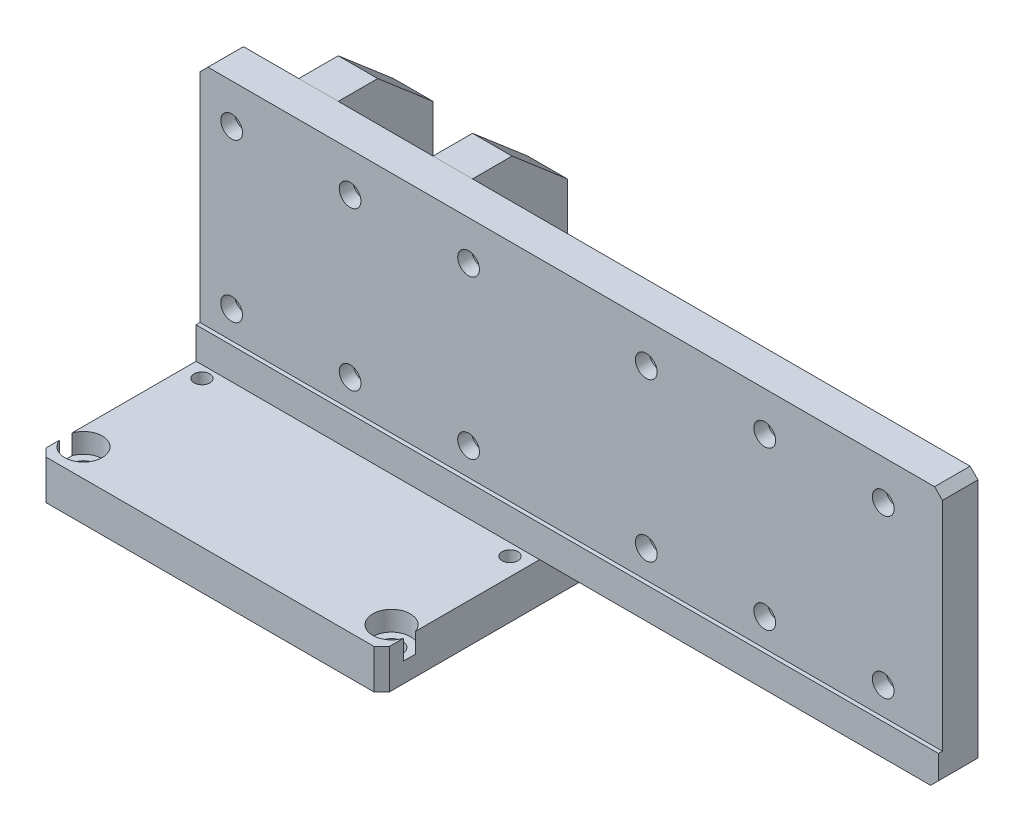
from build123d import *

# Parameters (mm, degrees)
SKETCH_1_W                  = 87
SKETCH_1_H                  = 74
EXTRUDE_1_DEPTH             = 10
SKETCH_2_W                  = 188
SKETCH_2_H                  = 10
EXTRUDE_2_DEPTH             = 65
SKETCH_3_W                  = 188
SKETCH_3_H                  = 57
CUT_EXTRUDE_1_DEPTH         = 1
SKETCH_4_W                  = 10
SKETCH_4_H                  = 24
EXTRUDE_3_DEPTH             = 65
EXTRUDE_3_2_DEPTH           = 65
CUT_EXTRUDE_2_DEPTH         = 153.898659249
HOLE_WIZARD_M5_1_AT_2_COUNT = 2
HOLE_WIZARD_M5_1_AT_2_PITCH = 78
HOLE_WIZARD_M5_1_AT_3_COUNT = 2
HOLE_WIZARD_M5_1_AT_3_PITCH = 60
HOLE_WIZARD_M5_1_AT_4_COUNT = 2
HOLE_WIZARD_M5_1_AT_4_PITCH = 98.407316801
SKETCH_9_W                  = 2
SKETCH_9_H                  = 10
F_4_0MM_1_AT_2_COUNT        = 2
F_4_0MM_1_AT_2_PITCH        = 78
HOLE_WIZARD_M5_2_AT_2_COUNT = 2
HOLE_WIZARD_M5_2_AT_2_PITCH = 30
HOLE_WIZARD_M5_2_AT_3_COUNT = 2
HOLE_WIZARD_M5_2_AT_3_PITCH = 60
HOLE_WIZARD_M5_2_AT_4_COUNT = 2
HOLE_WIZARD_M5_2_AT_4_PITCH = 72.111025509
HOLE_WIZARD_M5_2_AT_5_COUNT = 2
HOLE_WIZARD_M5_2_AT_5_PITCH = 50
HOLE_WIZARD_M5_2_AT_6_COUNT = 2
HOLE_WIZARD_M5_2_AT_6_PITCH = 40
CHAMFER_1_SIZE              = 2
CHAMFER_2_SIZE              = 2
PATTERN_LINEAR_1_COUNT      = 2
PATTERN_LINEAR_1_PITCH      = 105


with BuildPart() as part:
    # Sketch 1 → Extrude 1 (new body)
    with BuildSketch(Plane(origin=(0, 0, 0), x_dir=(1, 0, 0), z_dir=(0, 1, 0))):
        Rectangle(SKETCH_1_W, SKETCH_1_H)
    extrude(amount=EXTRUDE_1_DEPTH)

    # Sketch 7 → Hole Wizard M5 _ _ _ _ _1 (revolve, cut)
    with BuildSketch(Plane(origin=(-39, 10, -30), x_dir=(0, 0, 1), z_dir=(1, 0, 0))):
        Polygon((0, 0), (0, 10), (2.75, 10), (2.75, 5), (4.75, 5), (4.75, 0), align=None)
    hole_wizard_m5_1 = revolve(axis=Axis((-39, 16.35, -30), (0, -1, 0)), mode=Mode.SUBTRACT)

    # Hole Wizard M5 _ _ _ _ _1 at 2: Hole Wizard M5 _ _ _ _ _1 ×2
    with Locations(*[(i * HOLE_WIZARD_M5_1_AT_2_PITCH, 0, 0) for i in range(1, HOLE_WIZARD_M5_1_AT_2_COUNT)]):
        add(hole_wizard_m5_1, mode=Mode.SUBTRACT)

    # Hole Wizard M5 _ _ _ _ _1 at 3: Hole Wizard M5 _ _ _ _ _1 ×2
    with Locations(*[(0, 0, i * HOLE_WIZARD_M5_1_AT_3_PITCH) for i in range(1, HOLE_WIZARD_M5_1_AT_3_COUNT)]):
        add(hole_wizard_m5_1, mode=Mode.SUBTRACT)

    # Hole Wizard M5 _ _ _ _ _1 at 4: Hole Wizard M5 _ _ _ _ _1 ×2
    with Locations(*[Vector(0.7926239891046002, 0, 0.6097107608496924) * (i * HOLE_WIZARD_M5_1_AT_4_PITCH) for i in range(1, HOLE_WIZARD_M5_1_AT_4_COUNT)]):
        add(hole_wizard_m5_1, mode=Mode.SUBTRACT)

    # Sketch 9 → 4.0mm _ _1 (revolve, cut)
    with BuildSketch(Plane(origin=(-39, 10, 0), x_dir=(0, 0, 1), z_dir=(1, 0, 0))):
        with Locations((1, 5)):
            Rectangle(SKETCH_9_W, SKETCH_9_H)
    f_4_0mm_1 = revolve(axis=Axis((-39, 16.35, 0), (0, -1, 0)), mode=Mode.SUBTRACT)

    # 4.0mm _ _1 at 2: 4.0mm _ _1 ×2
    with Locations(*[(i * F_4_0MM_1_AT_2_PITCH, 0, 0) for i in range(1, F_4_0MM_1_AT_2_COUNT)]):
        add(f_4_0mm_1, mode=Mode.SUBTRACT)

    # Chamfer 2
    chamfer_2_edges = [part.edges().sort_by_distance(p)[0] for p in [
        (43.5, 5, 37),
        (-43.5, 5, 37),
        (-43.5, 5, -37),
        (43.5, 5, -37),
    ]]
    chamfer(chamfer_2_edges, length=CHAMFER_2_SIZE)


with BuildPart() as body_2:
    # Sketch 2 → Extrude 2 (new body)
    with BuildSketch(Plane(origin=(0, 10, 0), x_dir=(1, 0, 0), z_dir=(0, 1, 0))):
        with Locations((50.5, 8)):
            Rectangle(SKETCH_2_W, SKETCH_2_H)
    extrude(amount=EXTRUDE_2_DEPTH)

    # Sketch 3 → Cut-Extrude 1 (cut)
    with BuildSketch(Plane.XY.offset(-3)):
        with Locations((50.5, 46.5)):
            Rectangle(SKETCH_3_W, SKETCH_3_H)
    extrude(amount=-CUT_EXTRUDE_1_DEPTH, mode=Mode.SUBTRACT)

    # Sketch 11 → Hole Wizard M5 _ _ _ _ _2 (revolve, cut)
    with BuildSketch(Plane(origin=(-35.5, 65, -13), x_dir=(0, 1, 0), z_dir=(1, 0, 0))):
        Polygon((0, 0), (0, 50), (2.75, 50), (2.75, 5.5), (4.75, 5.5), (4.75, 0), align=None)
    hole_wizard_m5_2 = revolve(axis=Axis((-35.5, 65, -19.35), (0, 0, 1)), mode=Mode.SUBTRACT)

    # Hole Wizard M5 _ _ _ _ _2 at 2: Hole Wizard M5 _ _ _ _ _2 ×2
    with Locations(*[(i * HOLE_WIZARD_M5_2_AT_2_PITCH, 0, 0) for i in range(1, HOLE_WIZARD_M5_2_AT_2_COUNT)]):
        add(hole_wizard_m5_2, mode=Mode.SUBTRACT)

    # Hole Wizard M5 _ _ _ _ _2 at 3: Hole Wizard M5 _ _ _ _ _2 ×2
    with Locations(*[(i * HOLE_WIZARD_M5_2_AT_3_PITCH, 0, 0) for i in range(1, HOLE_WIZARD_M5_2_AT_3_COUNT)]):
        add(hole_wizard_m5_2, mode=Mode.SUBTRACT)

    # Hole Wizard M5 _ _ _ _ _2 at 4: Hole Wizard M5 _ _ _ _ _2 ×2
    with Locations(*[Vector(0.8320502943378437, -0.5547001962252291, 0) * (i * HOLE_WIZARD_M5_2_AT_4_PITCH) for i in range(1, HOLE_WIZARD_M5_2_AT_4_COUNT)]):
        add(hole_wizard_m5_2, mode=Mode.SUBTRACT)

    # Hole Wizard M5 _ _ _ _ _2 at 5: Hole Wizard M5 _ _ _ _ _2 ×2
    with Locations(*[Vector(0.6, -0.8, 0) * (i * HOLE_WIZARD_M5_2_AT_5_PITCH) for i in range(1, HOLE_WIZARD_M5_2_AT_5_COUNT)]):
        add(hole_wizard_m5_2, mode=Mode.SUBTRACT)

    # Hole Wizard M5 _ _ _ _ _2 at 6: Hole Wizard M5 _ _ _ _ _2 ×2
    with Locations(*[(0, -i * HOLE_WIZARD_M5_2_AT_6_PITCH, 0) for i in range(1, HOLE_WIZARD_M5_2_AT_6_COUNT)]):
        add(hole_wizard_m5_2, mode=Mode.SUBTRACT)

    # Chamfer 1
    chamfer_1_edges = [body_2.edges().sort_by_distance(p)[0] for p in [
        (144.5, 75, -8.5),
        (-43.5, 75, -8.5),
        (144.5, 10, -8),
    ]]
    chamfer(chamfer_1_edges, length=CHAMFER_1_SIZE)

    # Pattern Linear 1: Hole Wizard M5 _ _ _ _ _2 ×2
    with Locations(*[(i * PATTERN_LINEAR_1_PITCH, 0, 0) for i in range(1, PATTERN_LINEAR_1_COUNT)]):
        add(hole_wizard_m5_2, mode=Mode.SUBTRACT)

    # Pattern Linear 1 copy 1 sketch → Pattern Linear 1 copy 1 (revolve, cut)
    with BuildSketch(Plane(origin=(99.5, 65, -13), x_dir=(0, 1, 0), z_dir=(1, 0, 0))):
        Polygon((0, 0), (0, 50), (2.75, 50), (2.75, 5.5), (4.75, 5.5), (4.75, 0), align=None)
    revolve(axis=Axis((99.5, 65, -19.35), (0, 0, 1)), mode=Mode.SUBTRACT)

    # Pattern Linear 1 copy 2 sketch → Pattern Linear 1 copy 2 (revolve, cut)
    with BuildSketch(Plane(origin=(129.5, 65, -13), x_dir=(0, 1, 0), z_dir=(1, 0, 0))):
        Polygon((0, 0), (0, 50), (2.75, 50), (2.75, 5.5), (4.75, 5.5), (4.75, 0), align=None)
    revolve(axis=Axis((129.5, 65, -19.35), (0, 0, 1)), mode=Mode.SUBTRACT)

    # Pattern Linear 1 copy 3 sketch → Pattern Linear 1 copy 3 (revolve, cut)
    with BuildSketch(Plane(origin=(129.5, 25, -13), x_dir=(0, 1, 0), z_dir=(1, 0, 0))):
        Polygon((0, 0), (0, 50), (2.75, 50), (2.75, 5.5), (4.75, 5.5), (4.75, 0), align=None)
    revolve(axis=Axis((129.5, 25, -19.35), (0, 0, 1)), mode=Mode.SUBTRACT)

    # Pattern Linear 1 copy 4 sketch → Pattern Linear 1 copy 4 (revolve, cut)
    with BuildSketch(Plane(origin=(99.5, 25, -13), x_dir=(0, 1, 0), z_dir=(1, 0, 0))):
        Polygon((0, 0), (0, 50), (2.75, 50), (2.75, 5.5), (4.75, 5.5), (4.75, 0), align=None)
    revolve(axis=Axis((99.5, 25, -19.35), (0, 0, 1)), mode=Mode.SUBTRACT)

    # Pattern Linear 1 copy 5 sketch → Pattern Linear 1 copy 5 (revolve, cut)
    with BuildSketch(Plane(origin=(69.5, 25, -13), x_dir=(0, 1, 0), z_dir=(1, 0, 0))):
        Polygon((0, 0), (0, 50), (2.75, 50), (2.75, 5.5), (4.75, 5.5), (4.75, 0), align=None)
    revolve(axis=Axis((69.5, 25, -19.35), (0, 0, 1)), mode=Mode.SUBTRACT)


with BuildPart() as body_3:
    # Sketch 4 → Extrude 3 (new body)
    with BuildSketch(Plane(origin=(0, 10, 0), x_dir=(1, 0, 0), z_dir=(0, 1, 0))):
        with Locations((-22.5, 25)):
            Rectangle(SKETCH_4_W, SKETCH_4_H)
    extrude(amount=EXTRUDE_3_DEPTH)


with BuildPart() as body_4:
    # Sketch 4 → Extrude 3 2 (new body)
    with BuildSketch(Plane(origin=(0, 10, 0), x_dir=(1, 0, 0), z_dir=(0, 1, 0))):
        with Locations((11.5, 25)):
            Rectangle(SKETCH_4_W, SKETCH_4_H)
    extrude(amount=EXTRUDE_3_2_DEPTH)


with BuildPart() as cut_extrude_2_tool:
    # Sketch 5 → Cut-Extrude 2 (new, through all)
    with BuildSketch(Plane(origin=(16.5, 0, 0), x_dir=(0, 0, -1), z_dir=(1, 0, 0))):
        Polygon((37, 75), (23, 75), (37, 63), align=None)
    extrude(amount=-CUT_EXTRUDE_2_DEPTH)


with BuildPart() as body_3_1:
    add(body_3.part)

    # Cut-Extrude 2: cut by cut_extrude_2_tool
    add(cut_extrude_2_tool.part, mode=Mode.SUBTRACT)


with BuildPart() as body_4_1:
    add(body_4.part)

    # Cut-Extrude 2: cut by cut_extrude_2_tool
    add(cut_extrude_2_tool.part, mode=Mode.SUBTRACT)


solid = Compound([part.part, body_2.part, body_3_1.part, body_4_1.part])
